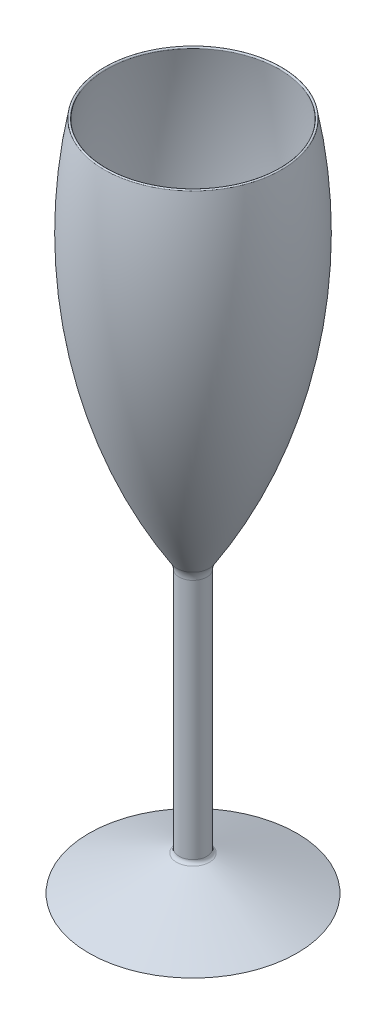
ISO-10303-21;
HEADER;
FILE_DESCRIPTION(('STEP AP214'),'2;1');
FILE_NAME('part.step','',(''),(''),'','','');
FILE_SCHEMA(('AUTOMOTIVE_DESIGN { 1 0 10303 214 1 1 1 1 }'));
ENDSEC;
DATA;
#1=APPLICATION_CONTEXT('core data for automotive mechanical design processes');
#2=APPLICATION_PROTOCOL_DEFINITION('international standard','automotive_design',2000,#1);
#3=PRODUCT_CONTEXT('',#1,'mechanical');
#4=PRODUCT('Part','Part','',(#3));
#5=PRODUCT_RELATED_PRODUCT_CATEGORY('part','',(#4));
#6=PRODUCT_DEFINITION_FORMATION('','',#4);
#7=PRODUCT_DEFINITION_CONTEXT('part definition',#1,'design');
#8=PRODUCT_DEFINITION('design','',#6,#7);
#9=PRODUCT_DEFINITION_SHAPE('','',#8);
#10=(LENGTH_UNIT() NAMED_UNIT(*) SI_UNIT(.MILLI.,.METRE.));
#11=(NAMED_UNIT(*) PLANE_ANGLE_UNIT() SI_UNIT($,.RADIAN.));
#12=(NAMED_UNIT(*) SI_UNIT($,.STERADIAN.) SOLID_ANGLE_UNIT());
#13=UNCERTAINTY_MEASURE_WITH_UNIT(LENGTH_MEASURE(1.E-05),#10,'distance_accuracy_value','');
#14=(GEOMETRIC_REPRESENTATION_CONTEXT(3) GLOBAL_UNCERTAINTY_ASSIGNED_CONTEXT((#13)) GLOBAL_UNIT_ASSIGNED_CONTEXT((#10,
#11,#12)) REPRESENTATION_CONTEXT('',''));
#15=CARTESIAN_POINT('',(0.,0.,0.));
#16=DIRECTION('',(0.,0.,1.));
#17=DIRECTION('',(1.,0.,0.));
#18=AXIS2_PLACEMENT_3D('',#15,#16,#17);
#19=CARTESIAN_POINT('',(0.,204.75125415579,-26.390677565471));
#20=CARTESIAN_POINT('',(-3.45351734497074,204.751254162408,-26.3906775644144));
#21=CARTESIAN_POINT('',(-6.9086410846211,204.751254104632,-25.7034107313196));
#22=CARTESIAN_POINT('',(-13.289909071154,204.751254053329,-23.0602029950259));
#23=CARTESIAN_POINT('',(-16.2190215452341,204.751254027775,-21.1030326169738));
#24=CARTESIAN_POINT('',(-21.1030326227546,204.751253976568,-16.2190215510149));
#25=CARTESIAN_POINT('',(-23.0602030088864,204.751253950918,-13.2899090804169));
#26=CARTESIAN_POINT('',(-25.7034107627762,204.751253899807,-6.90864109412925));
#27=CARTESIAN_POINT('',(-26.3906776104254,204.751253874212,-3.4535173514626));
#28=CARTESIAN_POINT('',(-26.3906776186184,204.751253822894,3.45351735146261));
#29=CARTESIAN_POINT('',(-25.7034107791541,204.751253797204,6.90864109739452));
#30=CARTESIAN_POINT('',(-23.0602030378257,204.751253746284,13.2899090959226));
#31=CARTESIAN_POINT('',(-21.1030326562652,204.751253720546,16.2190215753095));
#32=CARTESIAN_POINT('',(-16.219021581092,204.751253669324,21.1030326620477));
#33=CARTESIAN_POINT('',(-13.2899091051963,204.75125364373,23.0602030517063));
#34=CARTESIAN_POINT('',(-6.9086411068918,204.751253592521,25.7034108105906));
#35=CARTESIAN_POINT('',(-3.4535173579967,204.751253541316,26.3906776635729));
#36=CARTESIAN_POINT('',(3.4535173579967,204.751253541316,26.3906776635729));
#37=CARTESIAN_POINT('',(6.90864110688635,204.751253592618,25.7034108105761));
#38=CARTESIAN_POINT('',(13.2899091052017,204.751253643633,23.0602030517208));
#39=CARTESIAN_POINT('',(16.2190215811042,204.751253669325,21.1030326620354));
#40=CARTESIAN_POINT('',(21.1030326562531,204.751253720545,16.2190215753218));
#41=CARTESIAN_POINT('',(23.0602030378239,204.751253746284,13.2899090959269));
#42=CARTESIAN_POINT('',(25.7034107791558,204.751253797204,6.90864109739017));
#43=CARTESIAN_POINT('',(26.3906776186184,204.751253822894,3.45351735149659));
#44=CARTESIAN_POINT('',(26.3906776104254,204.751253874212,-3.45351735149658));
#45=CARTESIAN_POINT('',(25.703410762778,204.751253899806,-6.9086410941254));
#46=CARTESIAN_POINT('',(23.0602030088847,204.751253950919,-13.2899090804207));
#47=CARTESIAN_POINT('',(21.1030326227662,204.75125397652,-16.2190215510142));
#48=CARTESIAN_POINT('',(16.2190215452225,204.751254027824,-21.1030326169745));
#49=CARTESIAN_POINT('',(13.289909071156,204.751254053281,-23.0602029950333));
#50=CARTESIAN_POINT('',(6.90864108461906,204.75125410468,-25.7034107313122));
#51=CARTESIAN_POINT('',(3.45351734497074,204.751254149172,-26.3906775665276));
#52=CARTESIAN_POINT('',(0.,204.75125415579,-26.390677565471));
#53=CARTESIAN_POINT('',(3.22357900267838E-07,205.39899180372,-26.2872650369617));
#54=CARTESIAN_POINT('',(-3.43980943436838,205.398991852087,-26.2872649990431));
#55=CARTESIAN_POINT('',(-6.88173123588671,205.398992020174,-25.6026239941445));
#56=CARTESIAN_POINT('',(-13.2376701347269,205.39899223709,-22.9699076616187));
#57=CARTESIAN_POINT('',(-16.155590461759,205.398992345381,-21.0202154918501));
#58=CARTESIAN_POINT('',(-21.0202153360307,205.398992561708,-16.1555903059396));
#59=CARTESIAN_POINT('',(-22.9699072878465,205.398992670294,-13.2376698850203));
#60=CARTESIAN_POINT('',(-25.6026231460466,205.398992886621,-6.88173097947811));
#61=CARTESIAN_POINT('',(-26.2872638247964,205.398992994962,-3.43980925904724));
#62=CARTESIAN_POINT('',(-26.287263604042,205.39899321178,3.43980925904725));
#63=CARTESIAN_POINT('',(-25.6026227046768,205.398993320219,6.88173089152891));
#64=CARTESIAN_POINT('',(-22.9699065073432,205.39899353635,13.2376694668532));
#65=CARTESIAN_POINT('',(-21.0202144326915,205.398993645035,16.1555896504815));
#66=CARTESIAN_POINT('',(-16.1555894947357,205.398993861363,21.0202142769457));
#67=CARTESIAN_POINT('',(-13.2376692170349,205.398993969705,22.9699061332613));
#68=CARTESIAN_POINT('',(-6.88173063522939,205.398994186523,25.6026218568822));
#69=CARTESIAN_POINT('',(-3.43980908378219,205.398994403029,26.2872623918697));
#70=CARTESIAN_POINT('',(3.4398090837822,205.398994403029,26.2872623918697));
#71=CARTESIAN_POINT('',(6.88173063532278,205.398994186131,25.6026218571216));
#72=CARTESIAN_POINT('',(13.2376692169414,205.398993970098,22.9699061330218));
#73=CARTESIAN_POINT('',(16.1555894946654,205.398993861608,21.0202142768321));
#74=CARTESIAN_POINT('',(21.0202144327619,205.39899364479,16.1555896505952));
#75=CARTESIAN_POINT('',(22.9699065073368,205.39899353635,13.237669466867));
#76=CARTESIAN_POINT('',(25.6026227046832,205.398993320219,6.88173089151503));
#77=CARTESIAN_POINT('',(26.2872636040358,205.398993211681,3.43980925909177));
#78=CARTESIAN_POINT('',(26.2872638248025,205.39899299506,-3.43980925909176));
#79=CARTESIAN_POINT('',(25.6026231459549,205.39899288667,-6.8817309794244));
#80=CARTESIAN_POINT('',(22.9699072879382,205.398992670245,-13.237669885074));
#81=CARTESIAN_POINT('',(21.0202153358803,205.398992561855,-16.155590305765));
#82=CARTESIAN_POINT('',(16.1555904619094,205.398992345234,-21.0202154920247));
#83=CARTESIAN_POINT('',(13.2376701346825,205.39899223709,-22.9699076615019));
#84=CARTESIAN_POINT('',(6.88173123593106,205.398992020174,-25.6026239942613));
#85=CARTESIAN_POINT('',(3.43980943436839,205.398991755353,-26.2872650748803));
#86=CARTESIAN_POINT('',(3.22357900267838E-07,205.39899180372,-26.2872650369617));
#87=CARTESIAN_POINT('',(3.30385196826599E-07,205.511611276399,-26.933465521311));
#88=CARTESIAN_POINT('',(-3.5254669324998,205.511611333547,-26.9334655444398));
#89=CARTESIAN_POINT('',(-7.04988430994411,205.511611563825,-26.2324154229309));
#90=CARTESIAN_POINT('',(-13.5640978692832,205.511611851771,-23.5341399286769));
#91=CARTESIAN_POINT('',(-16.5519546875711,205.511611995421,-21.5377178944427));
#92=CARTESIAN_POINT('',(-21.5377179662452,205.511612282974,-16.5519547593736));
#93=CARTESIAN_POINT('',(-23.5341401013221,205.511612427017,-13.5640979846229));
#94=CARTESIAN_POINT('',(-26.2324158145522,205.511612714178,-7.04988442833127));
#95=CARTESIAN_POINT('',(-26.9334660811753,205.511612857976,-3.5254670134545));
#96=CARTESIAN_POINT('',(-26.9334661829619,205.51161314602,3.5254670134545));
#97=CARTESIAN_POINT('',(-26.2324160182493,205.511613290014,7.0498844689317));
#98=CARTESIAN_POINT('',(-23.5341404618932,205.511613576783,13.56409817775));
#99=CARTESIAN_POINT('',(-21.5377183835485,205.511613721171,16.5519550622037));
#100=CARTESIAN_POINT('',(-16.5519551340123,205.51161400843,21.5377184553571));
#101=CARTESIAN_POINT('',(-13.5640982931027,205.511614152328,23.5341406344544));
#102=CARTESIAN_POINT('',(-7.04988458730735,205.511614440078,26.2324164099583));
#103=CARTESIAN_POINT('',(-3.52546709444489,205.511614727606,26.9334667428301));
#104=CARTESIAN_POINT('',(3.5254670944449,205.511614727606,26.9334667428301));
#105=CARTESIAN_POINT('',(7.04988458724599,205.511614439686,26.2324164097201));
#106=CARTESIAN_POINT('',(13.564098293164,205.511614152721,23.5341406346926));
#107=CARTESIAN_POINT('',(16.5519551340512,205.511614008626,21.5377184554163));
#108=CARTESIAN_POINT('',(21.5377183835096,205.511613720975,16.5519550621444));
#109=CARTESIAN_POINT('',(23.5341404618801,205.511613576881,13.5640981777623));
#110=CARTESIAN_POINT('',(26.2324160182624,205.511613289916,7.04988446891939));
#111=CARTESIAN_POINT('',(26.9334661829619,205.511613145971,3.52546701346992));
#112=CARTESIAN_POINT('',(26.9334660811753,205.511612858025,-3.52546701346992));
#113=CARTESIAN_POINT('',(26.2324158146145,205.511612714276,-7.04988442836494));
#114=CARTESIAN_POINT('',(23.5341401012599,205.511612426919,-13.5640979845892));
#115=CARTESIAN_POINT('',(21.5377179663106,205.511612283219,-16.5519547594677));
#116=CARTESIAN_POINT('',(16.5519546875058,205.511611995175,-21.5377178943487));
#117=CARTESIAN_POINT('',(13.5640978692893,205.511611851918,-23.5341399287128));
#118=CARTESIAN_POINT('',(7.04988430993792,205.511611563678,-26.232415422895));
#119=CARTESIAN_POINT('',(3.52546693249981,205.511611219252,-26.9334654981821));
#120=CARTESIAN_POINT('',(3.30385196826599E-07,205.511611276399,-26.933465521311));
#121=CARTESIAN_POINT('',(0.,204.867078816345,-27.055269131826));
#122=CARTESIAN_POINT('',(-3.54161268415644,204.867078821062,-27.0552691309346));
#123=CARTESIAN_POINT('',(-7.08157978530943,204.867078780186,-26.3511259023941));
#124=CARTESIAN_POINT('',(-13.6256267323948,204.867078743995,-23.6404929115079));
#125=CARTESIAN_POINT('',(-16.6266659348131,204.867078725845,-21.6352626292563));
#126=CARTESIAN_POINT('',(-21.6352626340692,204.867078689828,-16.626665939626));
#127=CARTESIAN_POINT('',(-23.6404929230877,204.867078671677,-13.6256267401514));
#128=CARTESIAN_POINT('',(-26.3511259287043,204.867078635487,-7.08157979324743));
#129=CARTESIAN_POINT('',(-27.0552691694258,204.867078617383,-3.54161268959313));
#130=CARTESIAN_POINT('',(-27.0552691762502,204.867078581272,3.54161268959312));
#131=CARTESIAN_POINT('',(-26.3511259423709,204.867078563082,7.08157979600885));
#132=CARTESIAN_POINT('',(-23.6404929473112,204.867078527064,13.6256267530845));
#133=CARTESIAN_POINT('',(-21.6352626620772,204.867078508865,16.6266659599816));
#134=CARTESIAN_POINT('',(-16.6266659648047,204.867078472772,21.6352626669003));
#135=CARTESIAN_POINT('',(-13.625626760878,204.867078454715,23.6404929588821));
#136=CARTESIAN_POINT('',(-7.08157980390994,204.867078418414,26.3511259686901));
#137=CARTESIAN_POINT('',(-3.54161269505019,204.86707838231,27.0552692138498));
#138=CARTESIAN_POINT('',(3.54161269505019,204.86707838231,27.0552692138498));
#139=CARTESIAN_POINT('',(7.08157980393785,204.867078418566,26.3511259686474));
#140=CARTESIAN_POINT('',(13.6256267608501,204.867078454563,23.6404929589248));
#141=CARTESIAN_POINT('',(16.6266659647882,204.867078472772,21.6352626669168));
#142=CARTESIAN_POINT('',(21.6352626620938,204.867078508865,16.6266659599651));
#143=CARTESIAN_POINT('',(23.6404929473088,204.867078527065,13.6256267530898));
#144=CARTESIAN_POINT('',(26.3511259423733,204.867078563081,7.08157979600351));
#145=CARTESIAN_POINT('',(27.0552691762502,204.867078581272,3.54161268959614));
#146=CARTESIAN_POINT('',(27.0552691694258,204.867078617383,-3.54161268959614));
#147=CARTESIAN_POINT('',(26.3511259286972,204.867078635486,-7.08157979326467));
#148=CARTESIAN_POINT('',(23.6404929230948,204.867078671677,-13.6256267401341));
#149=CARTESIAN_POINT('',(21.6352626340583,204.867078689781,-16.6266659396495));
#150=CARTESIAN_POINT('',(16.6266659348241,204.867078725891,-21.6352626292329));
#151=CARTESIAN_POINT('',(13.6256267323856,204.867078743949,-23.6404929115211));
#152=CARTESIAN_POINT('',(7.08157978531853,204.867078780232,-26.3511259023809));
#153=CARTESIAN_POINT('',(3.54161268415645,204.867078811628,-27.0552691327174));
#154=CARTESIAN_POINT('',(0.,204.867078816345,-27.055269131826));
#155=(BOUNDED_SURFACE() B_SPLINE_SURFACE(3,3,((#19,#20,#21,#22,#23,#24,#25,#26,#27,#28,#29,#30,
#31,#32,#33,#34,#35,#36,#37,#38,#39,#40,#41,#42,#43,#44,#45,#46,#47,#48,#49,#50,#51,#52),(#53,
#54,#55,#56,#57,#58,#59,#60,#61,#62,#63,#64,#65,#66,#67,#68,#69,#70,#71,#72,#73,#74,#75,#76,#77,
#78,#79,#80,#81,#82,#83,#84,#85,#86),(#87,#88,#89,#90,#91,#92,#93,#94,#95,#96,#97,#98,#99,#100,
#101,#102,#103,#104,#105,#106,#107,#108,#109,#110,#111,#112,#113,#114,#115,#116,#117,#118,#119,
#120),(#121,#122,#123,#124,#125,#126,#127,#128,#129,#130,#131,#132,#133,#134,#135,#136,#137,
#138,#139,#140,#141,#142,#143,#144,#145,#146,#147,#148,#149,#150,#151,#152,#153,#154)),
.UNSPECIFIED.,.F.,.T.,.F.) B_SPLINE_SURFACE_WITH_KNOTS((4,4),(4,2,2,2,2,2,2,2,2,2,2,2,2,2,2,2,
4),(0.,1.),(0.5,0.5625,0.625,0.6875,0.75,0.8125,0.875,0.9375,1.,1.0625,1.125,1.1875,1.25,1.3125,
1.375,1.4375,1.5),.UNSPECIFIED.) GEOMETRIC_REPRESENTATION_ITEM() RATIONAL_B_SPLINE_SURFACE(((1.,
1.,1.,1.,1.,1.,1.,1.,1.,1.,1.,1.,1.,1.,1.,1.,1.,1.,1.,1.,1.,1.,1.,1.,1.,1.,1.,1.,1.,1.,1.,1.,1.,
1.),(0.342820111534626,0.342820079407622,0.342819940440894,0.342819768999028,0.342819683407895,
0.342819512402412,0.342819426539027,0.342819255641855,0.342819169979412,0.34281899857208,
0.342818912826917,0.342818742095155,0.342818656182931,0.342818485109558,0.342818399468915,
0.342818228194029,0.342818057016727,0.342818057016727,0.342818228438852,0.342818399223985,
0.342818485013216,0.342818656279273,0.342818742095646,0.342818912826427,0.342818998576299,
0.342819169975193,0.342819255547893,0.342819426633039,0.342819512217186,0.342819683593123,
0.34281976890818,0.342819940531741,0.342820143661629,0.342820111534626),(0.342820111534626,
0.342820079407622,0.342819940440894,0.342819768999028,0.342819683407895,0.342819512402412,
0.342819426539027,0.342819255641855,0.342819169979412,0.34281899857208,0.342818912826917,
0.342818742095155,0.342818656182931,0.342818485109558,0.342818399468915,0.342818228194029,
0.342818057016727,0.342818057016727,0.342818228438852,0.342818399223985,0.342818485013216,
0.342818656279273,0.342818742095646,0.342818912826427,0.342818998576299,0.342819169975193,
0.342819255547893,0.342819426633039,0.342819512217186,0.342819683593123,0.34281976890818,
0.342819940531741,0.342820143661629,0.342820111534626),(1.,1.,1.,1.,1.,1.,1.,1.,1.,1.,1.,1.,1.,
1.,1.,1.,1.,1.,1.,1.,1.,1.,1.,1.,1.,1.,1.,1.,1.,1.,1.,1.,1.,1.))) REPRESENTATION_ITEM('') SURFACE());
#156=CARTESIAN_POINT('',(0.,204.867078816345,-27.055269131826));
#157=CARTESIAN_POINT('',(-3.54161268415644,204.867078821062,-27.0552691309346));
#158=CARTESIAN_POINT('',(-7.08157978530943,204.867078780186,-26.3511259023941));
#159=CARTESIAN_POINT('',(-13.6256267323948,204.867078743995,-23.6404929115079));
#160=CARTESIAN_POINT('',(-16.6266659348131,204.867078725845,-21.6352626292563));
#161=CARTESIAN_POINT('',(-21.6352626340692,204.867078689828,-16.626665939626));
#162=CARTESIAN_POINT('',(-23.6404929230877,204.867078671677,-13.6256267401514));
#163=CARTESIAN_POINT('',(-26.3511259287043,204.867078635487,-7.08157979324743));
#164=CARTESIAN_POINT('',(-27.0552691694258,204.867078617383,-3.54161268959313));
#165=CARTESIAN_POINT('',(-27.0552691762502,204.867078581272,3.54161268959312));
#166=CARTESIAN_POINT('',(-26.3511259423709,204.867078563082,7.08157979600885));
#167=CARTESIAN_POINT('',(-23.6404929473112,204.867078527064,13.6256267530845));
#168=CARTESIAN_POINT('',(-21.6352626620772,204.867078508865,16.6266659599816));
#169=CARTESIAN_POINT('',(-16.6266659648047,204.867078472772,21.6352626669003));
#170=CARTESIAN_POINT('',(-13.625626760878,204.867078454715,23.6404929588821));
#171=CARTESIAN_POINT('',(-7.08157980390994,204.867078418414,26.3511259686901));
#172=CARTESIAN_POINT('',(-3.54161269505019,204.86707838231,27.0552692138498));
#173=CARTESIAN_POINT('',(3.54161269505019,204.86707838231,27.0552692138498));
#174=CARTESIAN_POINT('',(7.08157980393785,204.867078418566,26.3511259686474));
#175=CARTESIAN_POINT('',(13.6256267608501,204.867078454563,23.6404929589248));
#176=CARTESIAN_POINT('',(16.6266659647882,204.867078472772,21.6352626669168));
#177=CARTESIAN_POINT('',(21.6352626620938,204.867078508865,16.6266659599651));
#178=CARTESIAN_POINT('',(23.6404929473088,204.867078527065,13.6256267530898));
#179=CARTESIAN_POINT('',(26.3511259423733,204.867078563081,7.08157979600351));
#180=CARTESIAN_POINT('',(27.0552691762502,204.867078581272,3.54161268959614));
#181=CARTESIAN_POINT('',(27.0552691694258,204.867078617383,-3.54161268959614));
#182=CARTESIAN_POINT('',(26.3511259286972,204.867078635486,-7.08157979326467));
#183=CARTESIAN_POINT('',(23.6404929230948,204.867078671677,-13.6256267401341));
#184=CARTESIAN_POINT('',(21.6352626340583,204.867078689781,-16.6266659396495));
#185=CARTESIAN_POINT('',(16.6266659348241,204.867078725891,-21.6352626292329));
#186=CARTESIAN_POINT('',(13.6256267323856,204.867078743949,-23.6404929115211));
#187=CARTESIAN_POINT('',(7.08157978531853,204.867078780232,-26.3511259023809));
#188=CARTESIAN_POINT('',(3.54161268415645,204.867078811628,-27.0552691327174));
#189=CARTESIAN_POINT('',(0.,204.867078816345,-27.055269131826));
#190=(BOUNDED_CURVE() B_SPLINE_CURVE(3,(#156,#157,#158,#159,#160,#161,#162,#163,#164,#165,#166,
#167,#168,#169,#170,#171,#172,#173,#174,#175,#176,#177,#178,#179,#180,#181,#182,#183,#184,#185,
#186,#187,#188,#189),.UNSPECIFIED.,.T.,.F.) B_SPLINE_CURVE_WITH_KNOTS((4,2,2,2,2,2,2,2,2,2,2,2,
2,2,2,2,4),(0.5,0.5625,0.625,0.6875,0.75,0.8125,0.875,0.9375,1.,1.0625,1.125,1.1875,1.25,1.3125,
1.375,1.4375,1.5),
.UNSPECIFIED.) CURVE() GEOMETRIC_REPRESENTATION_ITEM() RATIONAL_B_SPLINE_CURVE((1.,1.,1.,1.,1.,
1.,1.,1.,1.,1.,1.,1.,1.,1.,1.,1.,1.,1.,1.,1.,1.,1.,1.,1.,1.,1.,1.,1.,1.,1.,1.,1.,1.,1.)) REPRESENTATION_ITEM(''));
#191=CARTESIAN_POINT('',(0.,204.867078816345,-27.055269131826));
#192=VERTEX_POINT('',#191);
#193=EDGE_CURVE('E75',#192,#192,#190,.F.);
#194=CARTESIAN_POINT('',(0.,204.75125415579,-26.390677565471));
#195=CARTESIAN_POINT('',(3.45351734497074,204.751254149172,-26.3906775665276));
#196=CARTESIAN_POINT('',(6.90864108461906,204.75125410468,-25.7034107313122));
#197=CARTESIAN_POINT('',(13.289909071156,204.751254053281,-23.0602029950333));
#198=CARTESIAN_POINT('',(16.2190215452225,204.751254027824,-21.1030326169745));
#199=CARTESIAN_POINT('',(21.1030326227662,204.75125397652,-16.2190215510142));
#200=CARTESIAN_POINT('',(23.0602030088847,204.751253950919,-13.2899090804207));
#201=CARTESIAN_POINT('',(25.703410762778,204.751253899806,-6.9086410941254));
#202=CARTESIAN_POINT('',(26.3906776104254,204.751253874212,-3.45351735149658));
#203=CARTESIAN_POINT('',(26.3906776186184,204.751253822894,3.45351735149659));
#204=CARTESIAN_POINT('',(25.7034107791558,204.751253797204,6.90864109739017));
#205=CARTESIAN_POINT('',(23.0602030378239,204.751253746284,13.2899090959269));
#206=CARTESIAN_POINT('',(21.1030326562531,204.751253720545,16.2190215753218));
#207=CARTESIAN_POINT('',(16.2190215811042,204.751253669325,21.1030326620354));
#208=CARTESIAN_POINT('',(13.2899091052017,204.751253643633,23.0602030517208));
#209=CARTESIAN_POINT('',(6.90864110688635,204.751253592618,25.7034108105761));
#210=CARTESIAN_POINT('',(3.4535173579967,204.751253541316,26.3906776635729));
#211=CARTESIAN_POINT('',(-3.4535173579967,204.751253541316,26.3906776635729));
#212=CARTESIAN_POINT('',(-6.9086411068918,204.751253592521,25.7034108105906));
#213=CARTESIAN_POINT('',(-13.2899091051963,204.75125364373,23.0602030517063));
#214=CARTESIAN_POINT('',(-16.219021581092,204.751253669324,21.1030326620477));
#215=CARTESIAN_POINT('',(-21.1030326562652,204.751253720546,16.2190215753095));
#216=CARTESIAN_POINT('',(-23.0602030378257,204.751253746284,13.2899090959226));
#217=CARTESIAN_POINT('',(-25.7034107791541,204.751253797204,6.90864109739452));
#218=CARTESIAN_POINT('',(-26.3906776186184,204.751253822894,3.45351735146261));
#219=CARTESIAN_POINT('',(-26.3906776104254,204.751253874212,-3.4535173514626));
#220=CARTESIAN_POINT('',(-25.7034107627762,204.751253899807,-6.90864109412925));
#221=CARTESIAN_POINT('',(-23.0602030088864,204.751253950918,-13.2899090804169));
#222=CARTESIAN_POINT('',(-21.1030326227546,204.751253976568,-16.2190215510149));
#223=CARTESIAN_POINT('',(-16.2190215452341,204.751254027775,-21.1030326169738));
#224=CARTESIAN_POINT('',(-13.289909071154,204.751254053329,-23.0602029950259));
#225=CARTESIAN_POINT('',(-6.9086410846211,204.751254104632,-25.7034107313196));
#226=CARTESIAN_POINT('',(-3.45351734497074,204.751254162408,-26.3906775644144));
#227=CARTESIAN_POINT('',(0.,204.75125415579,-26.390677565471));
#228=(BOUNDED_CURVE() B_SPLINE_CURVE(3,(#194,#195,#196,#197,#198,#199,#200,#201,#202,#203,#204,
#205,#206,#207,#208,#209,#210,#211,#212,#213,#214,#215,#216,#217,#218,#219,#220,#221,#222,#223,
#224,#225,#226,#227),.UNSPECIFIED.,.T.,.F.) B_SPLINE_CURVE_WITH_KNOTS((4,2,2,2,2,2,2,2,2,2,2,2,
2,2,2,2,4),(0.5,0.5625,0.625,0.6875,0.75,0.8125,0.875,0.9375,1.,1.0625,1.125,1.1875,1.25,1.3125,
1.375,1.4375,1.5),
.UNSPECIFIED.) CURVE() GEOMETRIC_REPRESENTATION_ITEM() RATIONAL_B_SPLINE_CURVE((1.,1.,1.,1.,1.,
1.,1.,1.,1.,1.,1.,1.,1.,1.,1.,1.,1.,1.,1.,1.,1.,1.,1.,1.,1.,1.,1.,1.,1.,1.,1.,1.,1.,1.)) REPRESENTATION_ITEM(''));
#229=CARTESIAN_POINT('',(0.,204.75125415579,-26.390677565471));
#230=VERTEX_POINT('',#229);
#231=EDGE_CURVE('E50',#230,#230,#228,.F.);
#232=ORIENTED_EDGE('',*,*,#193,.F.);
#233=EDGE_LOOP('',(#232));
#234=FACE_BOUND('',#233,.T.);
#235=ORIENTED_EDGE('',*,*,#231,.F.);
#236=EDGE_LOOP('',(#235));
#237=FACE_BOUND('',#236,.T.);
#238=ADVANCED_FACE('F28',(#234,#237),#155,.T.);
#239=CARTESIAN_POINT('',(0.,0.,0.));
#240=DIRECTION('',(0.,-1.,0.));
#241=DIRECTION('',(0.,0.,-1.));
#242=AXIS2_PLACEMENT_3D('',#239,#240,#241);
#243=PLANE('',#242);
#244=CARTESIAN_POINT('',(0.,0.,0.));
#245=DIRECTION('',(0.,1.,0.));
#246=DIRECTION('',(0.,0.,1.));
#247=AXIS2_PLACEMENT_3D('',#244,#245,#246);
#248=CIRCLE('',#247,31.75);
#249=CARTESIAN_POINT('',(0.,0.,-31.75));
#250=VERTEX_POINT('',#249);
#251=EDGE_CURVE('E119',#250,#250,#248,.T.);
#252=ORIENTED_EDGE('',*,*,#251,.F.);
#253=EDGE_LOOP('',(#252));
#254=FACE_BOUND('',#253,.T.);
#255=ADVANCED_FACE('F135',(#254),#243,.T.);
#256=CARTESIAN_POINT('',(0.,11.0170487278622,0.));
#257=DIRECTION('',(0.,-1.,0.));
#258=DIRECTION('',(0.,0.,-1.));
#259=AXIS2_PLACEMENT_3D('',#256,#257,#258);
#260=CONICAL_SURFACE('',#259,4.22800595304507,1.19003152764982);
#261=CARTESIAN_POINT('',(0.,10.6975978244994,0.));
#262=DIRECTION('',(0.,-1.,0.));
#263=DIRECTION('',(0.,0.,-1.));
#264=AXIS2_PLACEMENT_3D('',#261,#262,#263);
#265=CIRCLE('',#264,5.02603508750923);
#266=CARTESIAN_POINT('',(0.,10.6975978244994,-5.02603508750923));
#267=VERTEX_POINT('',#266);
#268=EDGE_CURVE('E10',#267,#267,#265,.T.);
#269=CARTESIAN_POINT('',(0.,10.6975978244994,-5.02603508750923));
#270=CARTESIAN_POINT('',(0.,10.5861645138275,-5.30440972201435));
#271=CARTESIAN_POINT('',(0.,10.4747312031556,-5.58278435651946));
#272=CARTESIAN_POINT('',(0.,10.2518645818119,-6.13953362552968));
#273=CARTESIAN_POINT('',(0.,10.14043127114,-6.4179082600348));
#274=CARTESIAN_POINT('',(0.,9.91756464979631,-6.97465752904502));
#275=CARTESIAN_POINT('',(0.,9.80613133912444,-7.25303216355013));
#276=CARTESIAN_POINT('',(0.,9.5832647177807,-7.80978143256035));
#277=CARTESIAN_POINT('',(0.,9.47183140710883,-8.08815606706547));
#278=CARTESIAN_POINT('',(0.,9.24896478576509,-8.64490533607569));
#279=CARTESIAN_POINT('',(0.,9.13753147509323,-8.9232799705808));
#280=CARTESIAN_POINT('',(0.,8.91466485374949,-9.48002923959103));
#281=CARTESIAN_POINT('',(0.,8.80323154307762,-9.75840387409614));
#282=CARTESIAN_POINT('',(0.,8.58036492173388,-10.3151531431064));
#283=CARTESIAN_POINT('',(0.,8.46893161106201,-10.5935277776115));
#284=CARTESIAN_POINT('',(0.,8.24606498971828,-11.1502770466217));
#285=CARTESIAN_POINT('',(0.,8.13463167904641,-11.4286516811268));
#286=CARTESIAN_POINT('',(0.,7.91176505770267,-11.985400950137));
#287=CARTESIAN_POINT('',(0.,7.8003317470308,-12.2637755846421));
#288=CARTESIAN_POINT('',(0.,7.57746512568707,-12.8205248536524));
#289=CARTESIAN_POINT('',(0.,7.4660318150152,-13.0988994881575));
#290=CARTESIAN_POINT('',(0.,7.24316519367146,-13.6556487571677));
#291=CARTESIAN_POINT('',(0.,7.13173188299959,-13.9340233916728));
#292=CARTESIAN_POINT('',(0.,6.90886526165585,-14.490772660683));
#293=CARTESIAN_POINT('',(0.,6.79743195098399,-14.7691472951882));
#294=CARTESIAN_POINT('',(0.,6.57456532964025,-15.3258965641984));
#295=CARTESIAN_POINT('',(0.,6.46313201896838,-15.6042711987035));
#296=CARTESIAN_POINT('',(0.,6.24026539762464,-16.1610204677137));
#297=CARTESIAN_POINT('',(0.,6.12883208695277,-16.4393951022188));
#298=CARTESIAN_POINT('',(0.,5.90596546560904,-16.9961443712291));
#299=CARTESIAN_POINT('',(0.,5.79453215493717,-17.2745190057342));
#300=CARTESIAN_POINT('',(0.,5.57166553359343,-17.8312682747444));
#301=CARTESIAN_POINT('',(0.,5.46023222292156,-18.1096429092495));
#302=CARTESIAN_POINT('',(0.,5.23736560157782,-18.6663921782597));
#303=CARTESIAN_POINT('',(0.,5.12593229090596,-18.9447668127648));
#304=CARTESIAN_POINT('',(0.,4.90306566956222,-19.5015160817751));
#305=CARTESIAN_POINT('',(0.,4.79163235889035,-19.7798907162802));
#306=CARTESIAN_POINT('',(0.,4.56876573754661,-20.3366399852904));
#307=CARTESIAN_POINT('',(0.,4.45733242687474,-20.6150146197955));
#308=CARTESIAN_POINT('',(0.,4.23446580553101,-21.1717638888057));
#309=CARTESIAN_POINT('',(0.,4.12303249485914,-21.4501385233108));
#310=CARTESIAN_POINT('',(0.,3.9001658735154,-22.0068877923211));
#311=CARTESIAN_POINT('',(0.,3.78873256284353,-22.2852624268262));
#312=CARTESIAN_POINT('',(0.,3.5658659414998,-22.8420116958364));
#313=CARTESIAN_POINT('',(0.,3.45443263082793,-23.1203863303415));
#314=CARTESIAN_POINT('',(0.,3.23156600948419,-23.6771355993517));
#315=CARTESIAN_POINT('',(0.,3.12013269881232,-23.9555102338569));
#316=CARTESIAN_POINT('',(0.,2.89726607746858,-24.5122595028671));
#317=CARTESIAN_POINT('',(0.,2.78583276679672,-24.7906341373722));
#318=CARTESIAN_POINT('',(0.,2.56296614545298,-25.3473834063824));
#319=CARTESIAN_POINT('',(0.,2.45153283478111,-25.6257580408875));
#320=CARTESIAN_POINT('',(0.,2.22866621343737,-26.1825073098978));
#321=CARTESIAN_POINT('',(0.,2.11723290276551,-26.4608819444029));
#322=CARTESIAN_POINT('',(0.,1.89436628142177,-27.0176312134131));
#323=CARTESIAN_POINT('',(0.,1.7829329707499,-27.2960058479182));
#324=CARTESIAN_POINT('',(0.,1.56006634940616,-27.8527551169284));
#325=CARTESIAN_POINT('',(0.,1.44863303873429,-28.1311297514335));
#326=CARTESIAN_POINT('',(0.,1.22576641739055,-28.6878790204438));
#327=CARTESIAN_POINT('',(0.,1.11433310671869,-28.9662536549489));
#328=CARTESIAN_POINT('',(0.,0.891466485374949,-29.5230029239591));
#329=CARTESIAN_POINT('',(0.,0.780033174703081,-29.8013775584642));
#330=CARTESIAN_POINT('',(0.,0.557166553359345,-30.3581268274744));
#331=CARTESIAN_POINT('',(0.,0.445733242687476,-30.6365014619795));
#332=CARTESIAN_POINT('',(0.,0.222866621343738,-31.1932507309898));
#333=CARTESIAN_POINT('',(0.,0.111433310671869,-31.4716253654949));
#334=CARTESIAN_POINT('',(0.,0.,-31.75));
#335=B_SPLINE_CURVE_WITH_KNOTS('',3,(#269,#270,#271,#272,#273,#274,#275,#276,#277,#278,#279,
#280,#281,#282,#283,#284,#285,#286,#287,#288,#289,#290,#291,#292,#293,#294,#295,#296,#297,#298,
#299,#300,#301,#302,#303,#304,#305,#306,#307,#308,#309,#310,#311,#312,#313,#314,#315,#316,#317,
#318,#319,#320,#321,#322,#323,#324,#325,#326,#327,#328,#329,#330,#331,#332,#333,#334),
.UNSPECIFIED.,.F.,.F.,(4,2,2,2,2,2,2,2,2,2,2,2,2,2,2,2,2,2,2,2,2,2,2,2,2,2,2,2,2,2,2,2,4),(0.,
0.899548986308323,1.79909797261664,2.69864695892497,3.59819594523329,4.49774493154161,
5.39729391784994,6.29684290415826,7.19639189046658,8.09594087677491,8.99548986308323,
9.89503884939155,10.7945878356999,11.6941368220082,12.5936858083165,13.4932347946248,
14.3927837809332,15.2923327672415,16.1918817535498,17.0914307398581,17.9909797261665,
18.8905287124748,19.7900776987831,20.6896266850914,21.5891756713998,22.4887246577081,
23.3882736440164,24.2878226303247,25.1873716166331,26.0869206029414,26.9864695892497,
27.886018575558,28.7855675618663),.UNSPECIFIED.);
#336=EDGE_CURVE('BSEAM133',#267,#250,#335,.T.);
#337=ORIENTED_EDGE('',*,*,#268,.T.);
#338=ORIENTED_EDGE('',*,*,#251,.T.);
#339=ORIENTED_EDGE('',*,*,#336,.T.);
#340=ORIENTED_EDGE('',*,*,#336,.F.);
#341=EDGE_LOOP('',(#337,#339,#338,#340));
#342=FACE_BOUND('',#341,.T.);
#343=ADVANCED_FACE('F133',(#342),#260,.T.);
#344=CARTESIAN_POINT('',(0.,197.571317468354,0.));
#345=DIRECTION('',(0.,1.,0.));
#346=DIRECTION('',(0.,0.,1.));
#347=AXIS2_PLACEMENT_3D('',#344,#345,#346);
#348=CYLINDRICAL_SURFACE('',#347,4.22800595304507);
#349=CARTESIAN_POINT('',(0.,11.876641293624,0.));
#350=DIRECTION('',(0.,1.,0.));
#351=DIRECTION('',(0.,0.,1.));
#352=AXIS2_PLACEMENT_3D('',#349,#350,#351);
#353=CIRCLE('',#352,4.22800595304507);
#354=CARTESIAN_POINT('',(0.,11.876641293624,4.22800595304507));
#355=VERTEX_POINT('',#354);
#356=EDGE_CURVE('E37',#355,#355,#353,.T.);
#357=ORIENTED_EDGE('',*,*,#356,.T.);
#358=EDGE_LOOP('',(#357));
#359=FACE_BOUND('',#358,.T.);
#360=CARTESIAN_POINT('',(0.,85.7409897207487,0.));
#361=DIRECTION('',(0.,1.,0.));
#362=DIRECTION('',(0.,0.,1.));
#363=AXIS2_PLACEMENT_3D('',#360,#361,#362);
#364=CIRCLE('',#363,4.22800595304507);
#365=CARTESIAN_POINT('',(0.,85.7409897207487,4.22800595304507));
#366=VERTEX_POINT('',#365);
#367=EDGE_CURVE('E41',#366,#366,#364,.F.);
#368=ORIENTED_EDGE('',*,*,#367,.T.);
#369=EDGE_LOOP('',(#368));
#370=FACE_BOUND('',#369,.T.);
#371=ADVANCED_FACE('F106',(#359,#370),#348,.T.);
#372=CARTESIAN_POINT('',(0.,174.749468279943,0.));
#373=DIRECTION('',(0.,1.,0.));
#374=DIRECTION('',(0.,0.,1.));
#375=AXIS2_PLACEMENT_3D('',#372,#373,#374);
#376=DEGENERATE_TOROIDAL_SURFACE('',#375,132.314207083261,162.190321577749,.F.);
#377=CARTESIAN_POINT('',(0.,88.4441773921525,0.));
#378=DIRECTION('',(0.,1.,0.));
#379=DIRECTION('',(0.,0.,1.));
#380=AXIS2_PLACEMENT_3D('',#377,#378,#379);
#381=CIRCLE('',#380,5.0069390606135);
#382=CARTESIAN_POINT('',(0.,88.4441773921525,5.0069390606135));
#383=VERTEX_POINT('',#382);
#384=EDGE_CURVE('E45',#383,#383,#381,.T.);
#385=ORIENTED_EDGE('',*,*,#384,.T.);
#386=EDGE_LOOP('',(#385));
#387=FACE_BOUND('',#386,.T.);
#388=ORIENTED_EDGE('',*,*,#193,.T.);
#389=EDGE_LOOP('',(#388));
#390=FACE_BOUND('',#389,.T.);
#391=ADVANCED_FACE('F101',(#387,#390),#376,.F.);
#392=CARTESIAN_POINT('',(-0.772460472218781,91.1999476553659,0.));
#393=DIRECTION('',(0.,1.,0.));
#394=DIRECTION('',(0.,0.,1.));
#395=AXIS2_PLACEMENT_3D('',#392,#393,#394);
#396=PLANE('',#395);
#397=CARTESIAN_POINT('',(0.,91.1999476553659,0.));
#398=DIRECTION('',(0.,-1.,0.));
#399=DIRECTION('',(0.,0.,-1.));
#400=AXIS2_PLACEMENT_3D('',#397,#398,#399);
#401=CIRCLE('',#400,0.772460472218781);
#402=CARTESIAN_POINT('',(0.,91.1999476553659,-0.772460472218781));
#403=VERTEX_POINT('',#402);
#404=EDGE_CURVE('E122',#403,#403,#401,.T.);
#405=ORIENTED_EDGE('',*,*,#404,.F.);
#406=EDGE_LOOP('',(#405));
#407=FACE_BOUND('',#406,.T.);
#408=ADVANCED_FACE('F97',(#407),#396,.T.);
#409=CARTESIAN_POINT('',(0.,93.7399476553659,0.));
#410=DIRECTION('',(0.,-1.,0.));
#411=DIRECTION('',(0.,0.,-1.));
#412=AXIS2_PLACEMENT_3D('',#409,#410,#411);
#413=DEGENERATE_TOROIDAL_SURFACE('',#412,0.772460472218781,2.54,.T.);
#414=ORIENTED_EDGE('',*,*,#404,.T.);
#415=EDGE_LOOP('',(#414));
#416=FACE_BOUND('',#415,.T.);
#417=CARTESIAN_POINT('',(0.,92.3687453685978,0.));
#418=DIRECTION('',(0.,-1.,0.));
#419=DIRECTION('',(0.,0.,-1.));
#420=AXIS2_PLACEMENT_3D('',#417,#418,#419);
#421=CIRCLE('',#420,2.91054472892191);
#422=CARTESIAN_POINT('',(0.,92.3687453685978,-2.91054472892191));
#423=VERTEX_POINT('',#422);
#424=EDGE_CURVE('E125',#423,#423,#421,.T.);
#425=ORIENTED_EDGE('',*,*,#424,.F.);
#426=EDGE_LOOP('',(#425));
#427=FACE_BOUND('',#426,.T.);
#428=ADVANCED_FACE('F92',(#416,#427),#413,.F.);
#429=CARTESIAN_POINT('',(0.,179.349489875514,0.));
#430=DIRECTION('',(0.,-1.,0.));
#431=DIRECTION('',(0.,0.,-1.));
#432=AXIS2_PLACEMENT_3D('',#429,#430,#431);
#433=DEGENERATE_TOROIDAL_SURFACE('',#432,132.71653397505,161.122172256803,.F.);
#434=ORIENTED_EDGE('',*,*,#231,.T.);
#435=EDGE_LOOP('',(#434));
#436=FACE_BOUND('',#435,.T.);
#437=ORIENTED_EDGE('',*,*,#424,.T.);
#438=EDGE_LOOP('',(#437));
#439=FACE_BOUND('',#438,.T.);
#440=ADVANCED_FACE('F81',(#436,#439),#433,.T.);
#441=CARTESIAN_POINT('',(0.,85.7409897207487,0.));
#442=DIRECTION('',(0.,1.,0.));
#443=DIRECTION('',(0.,0.,1.));
#444=AXIS2_PLACEMENT_3D('',#441,#442,#443);
#445=TOROIDAL_SURFACE('',#444,9.30800595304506,5.08);
#446=ORIENTED_EDGE('',*,*,#367,.F.);
#447=EDGE_LOOP('',(#446));
#448=FACE_BOUND('',#447,.T.);
#449=ORIENTED_EDGE('',*,*,#384,.F.);
#450=EDGE_LOOP('',(#449));
#451=FACE_BOUND('',#450,.T.);
#452=ADVANCED_FACE('F91',(#448,#451),#445,.F.);
#453=CARTESIAN_POINT('',(0.,11.876641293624,0.));
#454=DIRECTION('',(0.,1.,0.));
#455=DIRECTION('',(0.,0.,1.));
#456=AXIS2_PLACEMENT_3D('',#453,#454,#455);
#457=TOROIDAL_SURFACE('',#456,5.49800595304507,1.27);
#458=ORIENTED_EDGE('',*,*,#268,.F.);
#459=EDGE_LOOP('',(#458));
#460=FACE_BOUND('',#459,.T.);
#461=ORIENTED_EDGE('',*,*,#356,.F.);
#462=EDGE_LOOP('',(#461));
#463=FACE_BOUND('',#462,.T.);
#464=ADVANCED_FACE('F160',(#460,#463),#457,.F.);
#465=CLOSED_SHELL('',(#238,#255,#343,#371,#391,#408,#428,#440,#452,#464));
#466=MANIFOLD_SOLID_BREP('B2',#465);
#467=ADVANCED_BREP_SHAPE_REPRESENTATION('',(#18,#466),#14);
#468=SHAPE_DEFINITION_REPRESENTATION(#9,#467);
ENDSEC;
END-ISO-10303-21;
